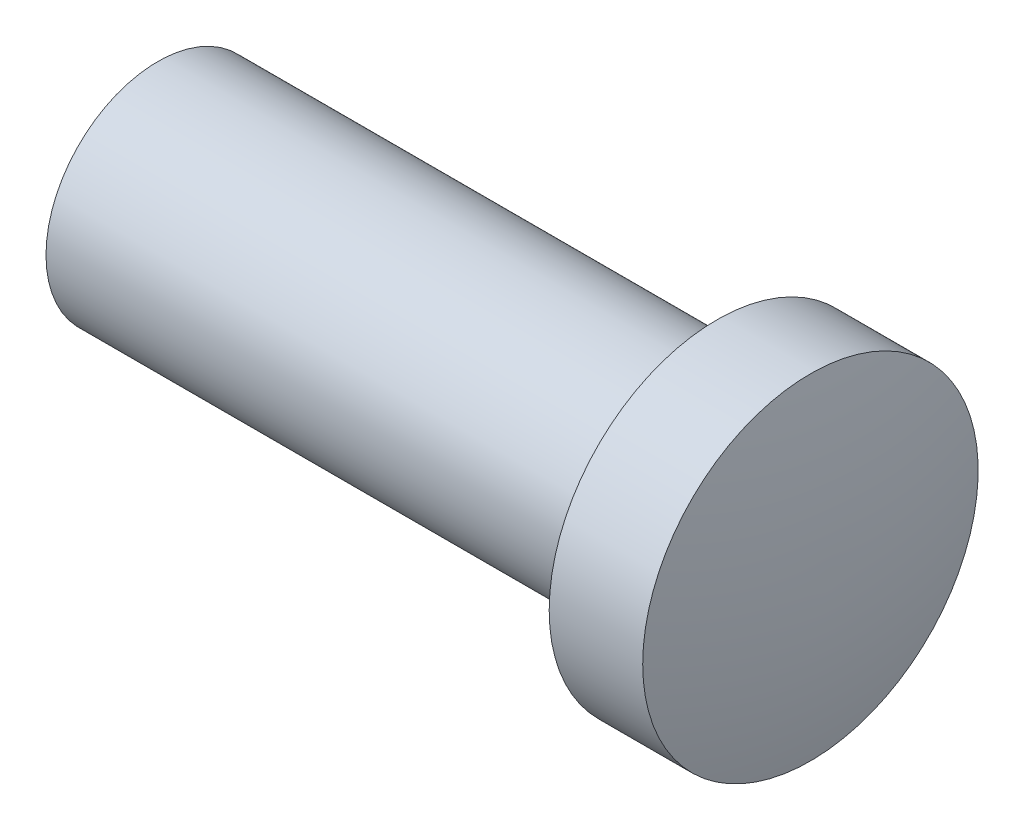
ISO-10303-21;
HEADER;
FILE_DESCRIPTION(('STEP AP214'),'2;1');
FILE_NAME('part.step','',(''),(''),'','','');
FILE_SCHEMA(('AUTOMOTIVE_DESIGN { 1 0 10303 214 1 1 1 1 }'));
ENDSEC;
DATA;
#1=APPLICATION_CONTEXT('core data for automotive mechanical design processes');
#2=APPLICATION_PROTOCOL_DEFINITION('international standard','automotive_design',2000,#1);
#3=PRODUCT_CONTEXT('',#1,'mechanical');
#4=PRODUCT('Part','Part','',(#3));
#5=PRODUCT_RELATED_PRODUCT_CATEGORY('part','',(#4));
#6=PRODUCT_DEFINITION_FORMATION('','',#4);
#7=PRODUCT_DEFINITION_CONTEXT('part definition',#1,'design');
#8=PRODUCT_DEFINITION('design','',#6,#7);
#9=PRODUCT_DEFINITION_SHAPE('','',#8);
#10=(LENGTH_UNIT() NAMED_UNIT(*) SI_UNIT(.MILLI.,.METRE.));
#11=(NAMED_UNIT(*) PLANE_ANGLE_UNIT() SI_UNIT($,.RADIAN.));
#12=(NAMED_UNIT(*) SI_UNIT($,.STERADIAN.) SOLID_ANGLE_UNIT());
#13=UNCERTAINTY_MEASURE_WITH_UNIT(LENGTH_MEASURE(1.E-05),#10,'distance_accuracy_value','');
#14=(GEOMETRIC_REPRESENTATION_CONTEXT(3) GLOBAL_UNCERTAINTY_ASSIGNED_CONTEXT((#13)) GLOBAL_UNIT_ASSIGNED_CONTEXT((#10,
#11,#12)) REPRESENTATION_CONTEXT('',''));
#15=CARTESIAN_POINT('',(0.,0.,0.));
#16=DIRECTION('',(0.,0.,1.));
#17=DIRECTION('',(1.,0.,0.));
#18=AXIS2_PLACEMENT_3D('',#15,#16,#17);
#19=CARTESIAN_POINT('',(-68.6445910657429,151.804700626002,0.));
#20=DIRECTION('',(1.,0.,0.));
#21=DIRECTION('',(0.,0.,-1.));
#22=AXIS2_PLACEMENT_3D('',#19,#20,#21);
#23=PLANE('',#22);
#24=CARTESIAN_POINT('',(-68.6445910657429,151.804700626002,0.));
#25=DIRECTION('',(-1.,0.,0.));
#26=DIRECTION('',(0.,0.,1.));
#27=AXIS2_PLACEMENT_3D('',#24,#25,#26);
#28=CIRCLE('',#27,0.75);
#29=CARTESIAN_POINT('',(-68.6445910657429,151.804700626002,0.75));
#30=VERTEX_POINT('',#29);
#31=EDGE_CURVE('E68',#30,#30,#28,.T.);
#32=ORIENTED_EDGE('',*,*,#31,.F.);
#33=EDGE_LOOP('',(#32));
#34=FACE_BOUND('',#33,.T.);
#35=CARTESIAN_POINT('',(-68.6445910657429,151.804700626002,0.));
#36=DIRECTION('',(-1.,0.,0.));
#37=DIRECTION('',(0.,0.,1.));
#38=AXIS2_PLACEMENT_3D('',#35,#36,#37);
#39=CIRCLE('',#38,1.);
#40=CARTESIAN_POINT('',(-68.6445910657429,151.804700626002,1.));
#41=VERTEX_POINT('',#40);
#42=EDGE_CURVE('E11',#41,#41,#39,.T.);
#43=ORIENTED_EDGE('',*,*,#42,.T.);
#44=EDGE_LOOP('',(#43));
#45=FACE_BOUND('',#44,.T.);
#46=ADVANCED_FACE('F32',(#34,#45),#23,.F.);
#47=CARTESIAN_POINT('',(-100.,151.804700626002,0.));
#48=DIRECTION('',(-1.,0.,0.));
#49=DIRECTION('',(0.,0.,1.));
#50=AXIS2_PLACEMENT_3D('',#47,#48,#49);
#51=CYLINDRICAL_SURFACE('',#50,1.);
#52=ORIENTED_EDGE('',*,*,#42,.F.);
#53=EDGE_LOOP('',(#52));
#54=FACE_BOUND('',#53,.T.);
#55=CARTESIAN_POINT('',(-63.6445910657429,151.804700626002,0.));
#56=DIRECTION('',(-1.,0.,0.));
#57=DIRECTION('',(0.,0.,1.));
#58=AXIS2_PLACEMENT_3D('',#55,#56,#57);
#59=CIRCLE('',#58,1.);
#60=CARTESIAN_POINT('',(-63.6445910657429,151.804700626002,1.));
#61=VERTEX_POINT('',#60);
#62=EDGE_CURVE('E38',#61,#61,#59,.T.);
#63=ORIENTED_EDGE('',*,*,#62,.T.);
#64=EDGE_LOOP('',(#63));
#65=FACE_BOUND('',#64,.T.);
#66=ADVANCED_FACE('F59',(#54,#65),#51,.T.);
#67=CARTESIAN_POINT('',(-63.6445910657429,152.804700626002,0.));
#68=DIRECTION('',(1.,0.,0.));
#69=DIRECTION('',(0.,0.,-1.));
#70=AXIS2_PLACEMENT_3D('',#67,#68,#69);
#71=PLANE('',#70);
#72=ORIENTED_EDGE('',*,*,#62,.F.);
#73=EDGE_LOOP('',(#72));
#74=FACE_BOUND('',#73,.T.);
#75=CARTESIAN_POINT('',(-63.6445910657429,151.804700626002,0.));
#76=DIRECTION('',(-1.,0.,0.));
#77=DIRECTION('',(0.,0.,1.));
#78=AXIS2_PLACEMENT_3D('',#75,#76,#77);
#79=CIRCLE('',#78,1.5);
#80=CARTESIAN_POINT('',(-63.6445910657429,151.804700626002,1.5));
#81=VERTEX_POINT('',#80);
#82=EDGE_CURVE('E74',#81,#81,#79,.T.);
#83=ORIENTED_EDGE('',*,*,#82,.T.);
#84=EDGE_LOOP('',(#83));
#85=FACE_BOUND('',#84,.T.);
#86=ADVANCED_FACE('F54',(#74,#85),#71,.F.);
#87=CARTESIAN_POINT('',(-100.,151.804700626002,0.));
#88=DIRECTION('',(-1.,0.,0.));
#89=DIRECTION('',(0.,0.,1.));
#90=AXIS2_PLACEMENT_3D('',#87,#88,#89);
#91=CYLINDRICAL_SURFACE('',#90,1.5);
#92=ORIENTED_EDGE('',*,*,#82,.F.);
#93=EDGE_LOOP('',(#92));
#94=FACE_BOUND('',#93,.T.);
#95=CARTESIAN_POINT('',(-62.8082898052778,151.804700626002,0.));
#96=DIRECTION('',(-1.,0.,0.));
#97=DIRECTION('',(0.,0.,1.));
#98=AXIS2_PLACEMENT_3D('',#95,#96,#97);
#99=CIRCLE('',#98,1.5);
#100=CARTESIAN_POINT('',(-62.8082898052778,151.804700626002,1.5));
#101=VERTEX_POINT('',#100);
#102=EDGE_CURVE('E76',#101,#101,#99,.T.);
#103=ORIENTED_EDGE('',*,*,#102,.T.);
#104=EDGE_LOOP('',(#103));
#105=FACE_BOUND('',#104,.T.);
#106=ADVANCED_FACE('F44',(#94,#105),#91,.T.);
#107=CARTESIAN_POINT('',(-69.1493032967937,151.804700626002,0.0490569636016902));
#108=DIRECTION('',(0.,-1.,0.));
#109=DIRECTION('',(0.,0.,1.));
#110=AXIS2_PLACEMENT_3D('',#107,#108,#109);
#111=CIRCLE('',#110,6.50489721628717);
#112=TRIMMED_CURVE('',#111,(PARAMETER_VALUE(-1.57833794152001)),
(PARAMETER_VALUE(1.57833794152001)),.T.,.PARAMETER.);
#113=CARTESIAN_POINT('',(-69.1493032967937,151.804700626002,0.));
#114=DIRECTION('',(-1.,0.,0.));
#115=AXIS1_PLACEMENT('',#113,#114);
#116=SURFACE_OF_REVOLUTION('',#112,#115);
#117=ORIENTED_EDGE('',*,*,#102,.F.);
#118=EDGE_LOOP('',(#117));
#119=FACE_BOUND('',#118,.T.);
#120=CARTESIAN_POINT('',(-62.6445910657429,151.804700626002,0.));
#121=VERTEX_POINT('',#120);
#122=VERTEX_LOOP('',#121);
#123=FACE_BOUND('',#122,.T.);
#124=ADVANCED_FACE('F41',(#119,#123),#116,.T.);
#125=CARTESIAN_POINT('',(-63.6445910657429,151.804700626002,0.));
#126=DIRECTION('',(-1.,0.,0.));
#127=DIRECTION('',(0.,0.,1.));
#128=AXIS2_PLACEMENT_3D('',#125,#126,#127);
#129=CYLINDRICAL_SURFACE('',#128,0.75);
#130=CARTESIAN_POINT('',(-63.6445910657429,151.804700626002,0.));
#131=DIRECTION('',(-1.,0.,0.));
#132=DIRECTION('',(0.,0.,1.));
#133=AXIS2_PLACEMENT_3D('',#130,#131,#132);
#134=CIRCLE('',#133,0.75);
#135=CARTESIAN_POINT('',(-63.6445910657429,151.804700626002,0.75));
#136=VERTEX_POINT('',#135);
#137=EDGE_CURVE('E81',#136,#136,#134,.T.);
#138=ORIENTED_EDGE('',*,*,#137,.F.);
#139=EDGE_LOOP('',(#138));
#140=FACE_BOUND('',#139,.T.);
#141=ORIENTED_EDGE('',*,*,#31,.T.);
#142=EDGE_LOOP('',(#141));
#143=FACE_BOUND('',#142,.T.);
#144=ADVANCED_FACE('F43',(#140,#143),#129,.F.);
#145=CARTESIAN_POINT('',(-63.6445910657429,151.804700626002,0.));
#146=DIRECTION('',(-1.,0.,0.));
#147=DIRECTION('',(0.,0.,1.));
#148=AXIS2_PLACEMENT_3D('',#145,#146,#147);
#149=PLANE('',#148);
#150=ORIENTED_EDGE('',*,*,#137,.T.);
#151=EDGE_LOOP('',(#150));
#152=FACE_BOUND('',#151,.T.);
#153=ADVANCED_FACE('F51',(#152),#149,.T.);
#154=CLOSED_SHELL('',(#46,#66,#86,#106,#124,#144,#153));
#155=MANIFOLD_SOLID_BREP('B2',#154);
#156=ADVANCED_BREP_SHAPE_REPRESENTATION('',(#18,#155),#14);
#157=SHAPE_DEFINITION_REPRESENTATION(#9,#156);
ENDSEC;
END-ISO-10303-21;
